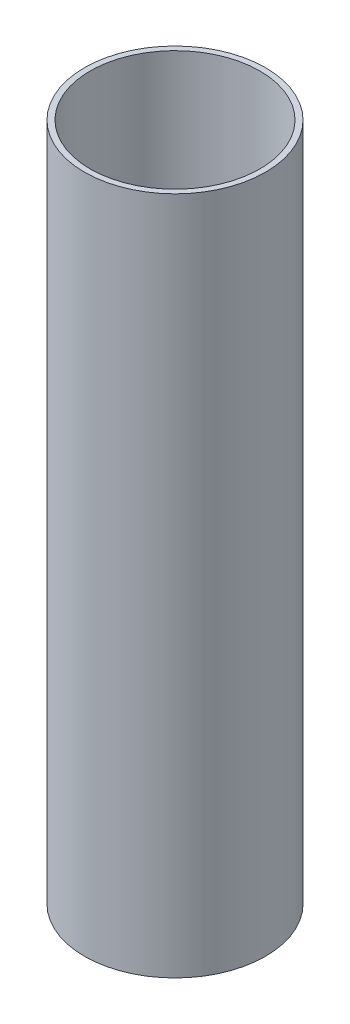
ISO-10303-21;
HEADER;
FILE_DESCRIPTION(('STEP AP214'),'2;1');
FILE_NAME('part.step','',(''),(''),'','','');
FILE_SCHEMA(('AUTOMOTIVE_DESIGN { 1 0 10303 214 1 1 1 1 }'));
ENDSEC;
DATA;
#1=APPLICATION_CONTEXT('core data for automotive mechanical design processes');
#2=APPLICATION_PROTOCOL_DEFINITION('international standard','automotive_design',2000,#1);
#3=PRODUCT_CONTEXT('',#1,'mechanical');
#4=PRODUCT('Part','Part','',(#3));
#5=PRODUCT_RELATED_PRODUCT_CATEGORY('part','',(#4));
#6=PRODUCT_DEFINITION_FORMATION('','',#4);
#7=PRODUCT_DEFINITION_CONTEXT('part definition',#1,'design');
#8=PRODUCT_DEFINITION('design','',#6,#7);
#9=PRODUCT_DEFINITION_SHAPE('','',#8);
#10=(LENGTH_UNIT() NAMED_UNIT(*) SI_UNIT(.MILLI.,.METRE.));
#11=(NAMED_UNIT(*) PLANE_ANGLE_UNIT() SI_UNIT($,.RADIAN.));
#12=(NAMED_UNIT(*) SI_UNIT($,.STERADIAN.) SOLID_ANGLE_UNIT());
#13=UNCERTAINTY_MEASURE_WITH_UNIT(LENGTH_MEASURE(1.E-05),#10,'distance_accuracy_value','');
#14=(GEOMETRIC_REPRESENTATION_CONTEXT(3) GLOBAL_UNCERTAINTY_ASSIGNED_CONTEXT((#13)) GLOBAL_UNIT_ASSIGNED_CONTEXT((#10,
#11,#12)) REPRESENTATION_CONTEXT('',''));
#15=CARTESIAN_POINT('',(0.,0.,0.));
#16=DIRECTION('',(0.,0.,1.));
#17=DIRECTION('',(1.,0.,0.));
#18=AXIS2_PLACEMENT_3D('',#15,#16,#17);
#19=CARTESIAN_POINT('',(0.,381.,0.));
#20=DIRECTION('',(0.,1.,0.));
#21=DIRECTION('',(0.,0.,1.));
#22=AXIS2_PLACEMENT_3D('',#19,#20,#21);
#23=PLANE('',#22);
#24=CARTESIAN_POINT('',(0.,381.,0.));
#25=DIRECTION('',(0.,1.,0.));
#26=DIRECTION('',(0.,0.,1.));
#27=AXIS2_PLACEMENT_3D('',#24,#25,#26);
#28=CIRCLE('',#27,50.8);
#29=CARTESIAN_POINT('',(0.,381.,50.8));
#30=VERTEX_POINT('',#29);
#31=EDGE_CURVE('E10',#30,#30,#28,.T.);
#32=ORIENTED_EDGE('',*,*,#31,.T.);
#33=EDGE_LOOP('',(#32));
#34=FACE_BOUND('',#33,.T.);
#35=CARTESIAN_POINT('',(0.,381.,0.));
#36=DIRECTION('',(0.,1.,0.));
#37=DIRECTION('',(0.,0.,1.));
#38=AXIS2_PLACEMENT_3D('',#35,#36,#37);
#39=CIRCLE('',#38,47.625);
#40=CARTESIAN_POINT('',(0.,381.,47.625));
#41=VERTEX_POINT('',#40);
#42=EDGE_CURVE('E42',#41,#41,#39,.T.);
#43=ORIENTED_EDGE('',*,*,#42,.F.);
#44=EDGE_LOOP('',(#43));
#45=FACE_BOUND('',#44,.T.);
#46=ADVANCED_FACE('F31',(#34,#45),#23,.T.);
#47=CARTESIAN_POINT('',(0.,0.,0.));
#48=DIRECTION('',(0.,1.,0.));
#49=DIRECTION('',(0.,0.,1.));
#50=AXIS2_PLACEMENT_3D('',#47,#48,#49);
#51=PLANE('',#50);
#52=CARTESIAN_POINT('',(0.,0.,0.));
#53=DIRECTION('',(0.,1.,0.));
#54=DIRECTION('',(0.,0.,1.));
#55=AXIS2_PLACEMENT_3D('',#52,#53,#54);
#56=CIRCLE('',#55,50.8);
#57=CARTESIAN_POINT('',(0.,0.,50.8));
#58=VERTEX_POINT('',#57);
#59=EDGE_CURVE('E35',#58,#58,#56,.T.);
#60=ORIENTED_EDGE('',*,*,#59,.F.);
#61=EDGE_LOOP('',(#60));
#62=FACE_BOUND('',#61,.T.);
#63=CARTESIAN_POINT('',(0.,0.,0.));
#64=DIRECTION('',(0.,1.,0.));
#65=DIRECTION('',(0.,0.,1.));
#66=AXIS2_PLACEMENT_3D('',#63,#64,#65);
#67=CIRCLE('',#66,47.625);
#68=CARTESIAN_POINT('',(0.,0.,47.625));
#69=VERTEX_POINT('',#68);
#70=EDGE_CURVE('E44',#69,#69,#67,.T.);
#71=ORIENTED_EDGE('',*,*,#70,.T.);
#72=EDGE_LOOP('',(#71));
#73=FACE_BOUND('',#72,.T.);
#74=ADVANCED_FACE('F54',(#62,#73),#51,.F.);
#75=CARTESIAN_POINT('',(0.,381.,0.));
#76=DIRECTION('',(0.,-1.,0.));
#77=DIRECTION('',(0.,0.,-1.));
#78=AXIS2_PLACEMENT_3D('',#75,#76,#77);
#79=CYLINDRICAL_SURFACE('',#78,50.8);
#80=ORIENTED_EDGE('',*,*,#31,.F.);
#81=EDGE_LOOP('',(#80));
#82=FACE_BOUND('',#81,.T.);
#83=ORIENTED_EDGE('',*,*,#59,.T.);
#84=EDGE_LOOP('',(#83));
#85=FACE_BOUND('',#84,.T.);
#86=ADVANCED_FACE('F33',(#82,#85),#79,.T.);
#87=CARTESIAN_POINT('',(0.,381.,0.));
#88=DIRECTION('',(0.,-1.,0.));
#89=DIRECTION('',(0.,0.,-1.));
#90=AXIS2_PLACEMENT_3D('',#87,#88,#89);
#91=CYLINDRICAL_SURFACE('',#90,47.625);
#92=ORIENTED_EDGE('',*,*,#42,.T.);
#93=EDGE_LOOP('',(#92));
#94=FACE_BOUND('',#93,.T.);
#95=ORIENTED_EDGE('',*,*,#70,.F.);
#96=EDGE_LOOP('',(#95));
#97=FACE_BOUND('',#96,.T.);
#98=ADVANCED_FACE('F50',(#94,#97),#91,.F.);
#99=CLOSED_SHELL('',(#46,#74,#86,#98));
#100=MANIFOLD_SOLID_BREP('B2',#99);
#101=ADVANCED_BREP_SHAPE_REPRESENTATION('',(#18,#100),#14);
#102=SHAPE_DEFINITION_REPRESENTATION(#9,#101);
ENDSEC;
END-ISO-10303-21;
